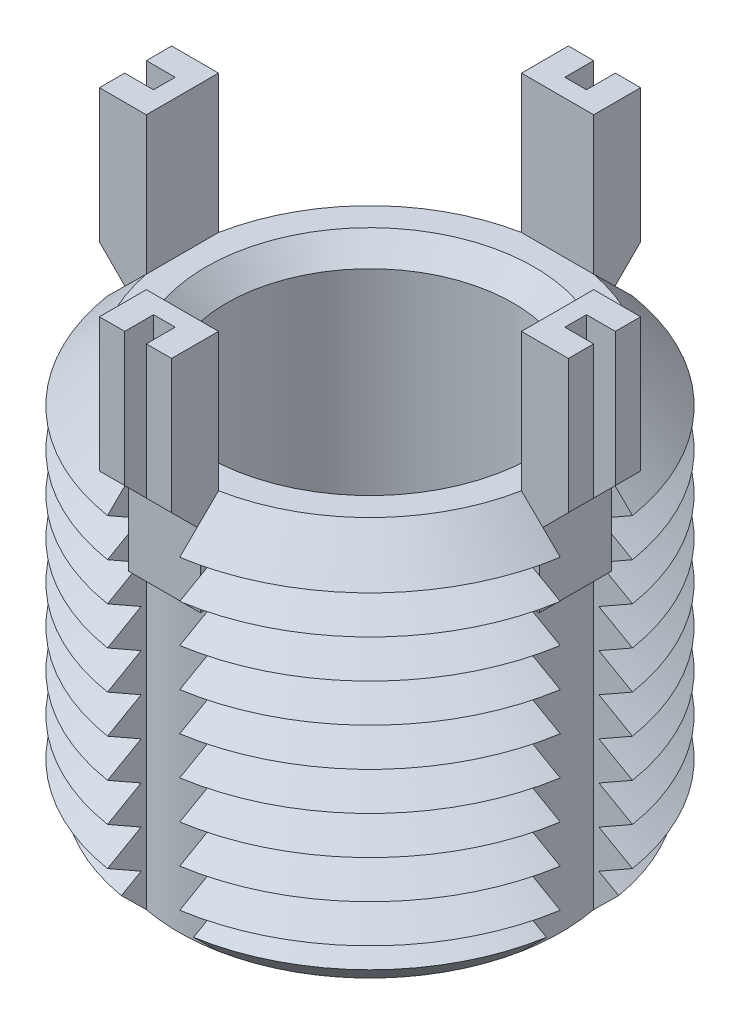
from build123d import *

# Parameters (mm, degrees)
SKETCH1_R               = 12.7
BOSS_EXTRUDE1_DEPTH     = 22.098
CHAMFER1_SIZE           = 2.117
LPATTERN1_COUNT         = 9
LPATTERN1_PITCH         = 2.117
CUT_EXTRUDE1_REACH      = 30.476
CIRPATTERN1_COUNT       = 4
BOSS_EXTRUDE3_DEPTH     = 2
CIRPATTERN2_COUNT       = 4
CUT_EXTRUDE3_DEPTH      = 35.96403449
CUT_EXTRUDE3_DEPTH_BACK = 35.96403449
SKETCH6_W               = 1.6
SKETCH6_H               = 1.2
SKETCH6_W_2             = 1.2
SKETCH6_H_2             = 1.6
SKETCH7_R               = 7.9375
CUT_EXTRUDE4_DEPTH      = 22.098
CHAMFER2_SIZE           = 1.1545


with BuildPart() as part:
    # Sketch1 → Boss-Extrude1 (new body)
    with BuildSketch(Plane(origin=(0, 0, 0), x_dir=(1, 0, 0), z_dir=(0, 1, 0))):
        with Locations(Location((0, 0, 0), (0, 0, 270))):
            Circle(SKETCH1_R)
    extrude(amount=-BOSS_EXTRUDE1_DEPTH)

    # Chamfer1
    chamfer1_edges = [part.edges().sort_by_distance(p)[0] for p in [
        (0, 0, -12.7),
        (0, -22.098, -12.7),
    ]]
    chamfer(chamfer1_edges, length=CHAMFER1_SIZE)

    # Sketch3 → Cut-Revolve1 (revolve, cut)
    with BuildSketch(Plane(origin=(0, 0, 0), x_dir=(0, 0, -1), z_dir=(1, 0, 0))):
        Polygon((-12.7, -2.117), (-10.86662422, -3.1755), (-12.7, -4.234), align=None)
    cut_revolve1 = revolve(axis=Axis((0, 0.885892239, 0), (0, -1, 0)), mode=Mode.SUBTRACT)

    # LPattern1: Cut-Revolve1 ×9
    with Locations(*[(0, -i * LPATTERN1_PITCH, 0) for i in range(1, LPATTERN1_COUNT)]):
        add(cut_revolve1, mode=Mode.SUBTRACT)

    # Cut-Extrude1: up to this cone (the profile starts inside it)
    cut_extrude1_end = Plane(origin=(0, 0, 0), z_dir=(0, 1, 0)).offset(-32.680999) * Cone(1e-06, 96.338, 96.337999, align=(Align.CENTER, Align.CENTER, Align.MIN), mode=Mode.PRIVATE)
    # Sketch4 → Cut-Extrude1 (cut, up to the surface)
    with BuildSketch(Plane(origin=(0, 0, 0), x_dir=(1, 0, 0), z_dir=(0, 1, 0)), mode=Mode.PRIVATE) as cut_extrude1_sk1:
        with BuildLine():
            Line((-10.392299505, 2), (-12.541531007, 2))
            ThreePointArc((-12.541531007, 2), (-12.7, 0), (-12.541531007, -2))
            Line((-12.541531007, -2), (-10.392299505, -2))
            ThreePointArc((-10.392299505, -2), (-10.583, 0), (-10.392299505, 2))
        make_face()
    cut_extrude1_tool1 = extrude(cut_extrude1_sk1.sketch, amount=-CUT_EXTRUDE1_REACH, mode=Mode.PRIVATE) & cut_extrude1_end
    cut_extrude1 = cut_extrude1_tool1.solids().sort_by_distance((-11.583253, 0, 0))[0]
    add(cut_extrude1, mode=Mode.SUBTRACT)

    # CirPattern1: Cut-Extrude1 ×4 about axis
    cirpattern1_axis = Axis((0, 0, 0), (0, 1, 0))
    for i in range(1, CIRPATTERN1_COUNT):
        add(cut_extrude1.rotate(cirpattern1_axis, i * 360 / CIRPATTERN1_COUNT), mode=Mode.SUBTRACT)

    # Sketch5 → Boss-Extrude3 (add, symmetric)
    with BuildSketch(Plane(origin=(0, 0, 0), x_dir=(0, 0, -1), z_dir=(1, 0, 0))):
        Polygon((-10.392299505, 7.649), (-10.392299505, -5.351), (-11.392299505, -5.351), (-11.392299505, -1.351), (-12.992299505, 0.249), (-12.992299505, 7.649), align=None)
    boss_extrude3 = extrude(amount=BOSS_EXTRUDE3_DEPTH, both=True)

    # CirPattern2: Boss-Extrude3 ×4 about axis
    cirpattern2_axis = Axis((0, 0, 0), (0, 1, 0))
    for i in range(1, CIRPATTERN2_COUNT):
        add(boss_extrude3.rotate(cirpattern2_axis, i * 360 / CIRPATTERN2_COUNT))

    # Sketch6 → Cut-Extrude3 (cut, two sides: drawn at the far end of the back side and taken through both)
    with BuildSketch(Plane(origin=(0, 7.649, 0), x_dir=(1, 0, 0), z_dir=(0, 1, 0)).offset(-CUT_EXTRUDE3_DEPTH_BACK)):
        with Locations((-12.192299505, 0)):
            Rectangle(SKETCH6_W, SKETCH6_H)
        with Locations((0, 12.192299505)):
            Rectangle(SKETCH6_W_2, SKETCH6_H_2)
        with Locations((12.192299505, 0)):
            Rectangle(SKETCH6_W, SKETCH6_H)
        with Locations((0, -12.192299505)):
            Rectangle(SKETCH6_W_2, SKETCH6_H_2)
    extrude(amount=CUT_EXTRUDE3_DEPTH + CUT_EXTRUDE3_DEPTH_BACK, mode=Mode.SUBTRACT)

    # Sketch7 → Cut-Extrude4 (cut)
    with BuildSketch(Plane(origin=(0, 0, 0), x_dir=(1, 0, 0), z_dir=(0, 1, 0))):
        with Locations(Location((0, 0, 0), (0, 0, 270))):
            Circle(SKETCH7_R)
    extrude(amount=-CUT_EXTRUDE4_DEPTH, mode=Mode.SUBTRACT)

    # Chamfer2
    chamfer2_edges = [part.edges().sort_by_distance(p)[0] for p in [
        (0, 0, -7.9375),
        (0, -22.098, -7.9375),
    ]]
    chamfer(chamfer2_edges, length=CHAMFER2_SIZE)


solid = part.part
